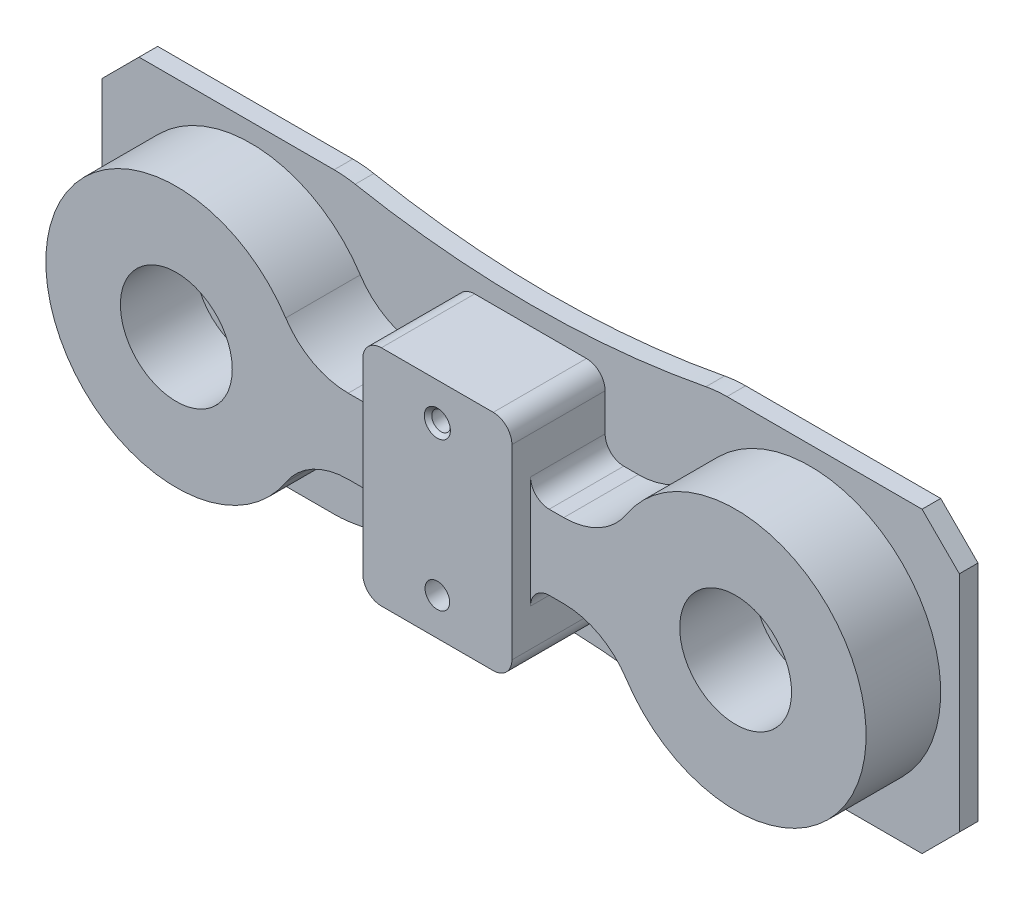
from build123d import *

# Parameters (mm, degrees)
AUFSATZ_LINEAR_AUSTRAGEN1_DEPTH                      = 5
AUFSATZ_LINEAR_AUSTRAGEN2_DEPTH                      = 20
SKIZZE4_R                                            = 15
SCHNITT_LINEAR_AUSTRAGEN1_DEPTH                      = 20
SKIZZE5_W                                            = 40
SKIZZE5_H                                            = 60
AUFSATZ_LINEAR_AUSTRAGEN3_DEPTH                      = 25
VERRUNDUNG1_R                                        = 5
M6_GEWINDEBOHRUNG1_D                                 = 5
M6_GEWINDEBOHRUNG1_DEPTH                             = 25
M6_GEWINDEBOHRUNG1_CSINK_D                           = 7
M6_GEWINDEBOHRUNG1_CSINK_ANGLE                       = 90
M6_GEWINDEBOHRUNG1_TIP                               = 1.502151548
STIRNSENKUNG_F_R_M6_ZYLINDERSCHRAUBE_MIT_D           = 6.6
STIRNSENKUNG_F_R_M6_ZYLINDERSCHRAUBE_MIT_CBORE_D     = 11
STIRNSENKUNG_F_R_M6_ZYLINDERSCHRAUBE_MIT_CBORE_DEPTH = 6.4
SCHNITT_LINEAR_AUSTRAGEN3_DEPTH                      = 125.298028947
VERRUNDUNG2_R                                        = 30


with BuildPart() as part:
    # Skizze2 → Aufsatz-Linear austragen1 (new body)
    with BuildSketch(Plane.XY):
        Polygon((-115, 30), (-105, 40), (105, 40), (115, 30), (115, -30), (105, -40), (-105, -40), (-115, -30), align=None)
    extrude(amount=AUFSATZ_LINEAR_AUSTRAGEN1_DEPTH)

    # Skizze3 → Aufsatz-Linear austragen2 (add)
    with BuildSketch(Plane.XY.offset(5)):
        with BuildLine():
            Line((-28.902277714, 10), (28.902277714, 10))
            ThreePointArc((28.902277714, 10), (38.436903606, 12.41901854), (45.665085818, 19.090909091))
            ThreePointArc((45.665085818, 19.090909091), (110, 0), (45.665085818, -19.090909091))
            ThreePointArc((45.665085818, -19.090909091), (38.436903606, -12.41901854), (28.902277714, -10))
            Line((28.902277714, -10), (-28.902277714, -10))
            ThreePointArc((-28.902277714, -10), (-38.436903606, -12.41901854), (-45.665085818, -19.090909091))
            ThreePointArc((-45.665085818, -19.090909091), (-110, 0), (-45.665085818, 19.090909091))
            ThreePointArc((-45.665085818, 19.090909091), (-38.436903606, 12.41901854), (-28.902277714, 10))
        make_face()
    extrude(amount=AUFSATZ_LINEAR_AUSTRAGEN2_DEPTH)

    # Skizze4 → Schnitt-Linear austragen1 (cut)
    with BuildSketch(Plane.XY.offset(25)):
        with Locations((-75, 0)):
            Circle(SKIZZE4_R)
        with Locations((75, 0)):
            Circle(SKIZZE4_R)
    extrude(amount=-SCHNITT_LINEAR_AUSTRAGEN1_DEPTH, mode=Mode.SUBTRACT)

    # Skizze5 → Aufsatz-Linear austragen3 (add)
    with BuildSketch(Plane.XY.offset(5)):
        Rectangle(SKIZZE5_W, SKIZZE5_H)
    extrude(amount=AUFSATZ_LINEAR_AUSTRAGEN3_DEPTH)

    # Verrundung1
    verrundung1_edges = [part.edges().sort_by_distance(p)[0] for p in [
        (20, -10, 15),
        (20, 10, 15),
        (20, -30, 17.5),
        (-20, -10, 15),
        (-20, 30, 17.5),
        (-20, 10, 15),
        (20, 30, 17.5),
        (-20, -30, 17.5),
    ]]
    fillet(verrundung1_edges, radius=VERRUNDUNG1_R)

    # M6 Gewindebohrung1
    with Locations(Plane.XY.offset(30)):
        with Locations((0, 20)):
            CounterSinkHole(M6_GEWINDEBOHRUNG1_D / 2, M6_GEWINDEBOHRUNG1_CSINK_D / 2, depth=M6_GEWINDEBOHRUNG1_DEPTH, counter_sink_angle=M6_GEWINDEBOHRUNG1_CSINK_ANGLE)
            with Locations((0, 0, -(M6_GEWINDEBOHRUNG1_DEPTH + M6_GEWINDEBOHRUNG1_TIP / 2))):  # 118° drill point
                Cone(0, M6_GEWINDEBOHRUNG1_D / 2, M6_GEWINDEBOHRUNG1_TIP, mode=Mode.SUBTRACT)

    # Stirnsenkung f_r M6 Zylinderschraube mit (through all)
    with Locations(Plane(origin=(0, 0, 0), x_dir=(-1, 0, 0), z_dir=(0, 0, -1))):
        with Locations((0, -20)):
            CounterBoreHole(STIRNSENKUNG_F_R_M6_ZYLINDERSCHRAUBE_MIT_D / 2, STIRNSENKUNG_F_R_M6_ZYLINDERSCHRAUBE_MIT_CBORE_D / 2, STIRNSENKUNG_F_R_M6_ZYLINDERSCHRAUBE_MIT_CBORE_DEPTH)

    # Skizze10 → Schnitt-Linear austragen3 (cut, through all)
    with BuildSketch(Plane.XY.offset(5)):
        with BuildLine():
            Line((-49.749371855, -40), (49.749371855, -40))
            ThreePointArc((49.749371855, -40), (0, -35), (-49.749371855, -40))
        make_face()
        with BuildLine():
            Line((-49.749371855, 40), (49.749371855, 40))
            ThreePointArc((49.749371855, 40), (0, 35), (-49.749371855, 40))
        make_face()
    extrude(amount=-SCHNITT_LINEAR_AUSTRAGEN3_DEPTH, mode=Mode.SUBTRACT)

    # Verrundung2
    verrundung2_edges = [part.edges().sort_by_distance(p)[0] for p in [
        (-49.749371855, -40, 2.5),
        (49.749371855, -40, 2.5),
        (49.749371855, 40, 2.5),
        (-49.749371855, 40, 2.5),
    ]]
    fillet(verrundung2_edges, radius=VERRUNDUNG2_R)


solid = part.part
